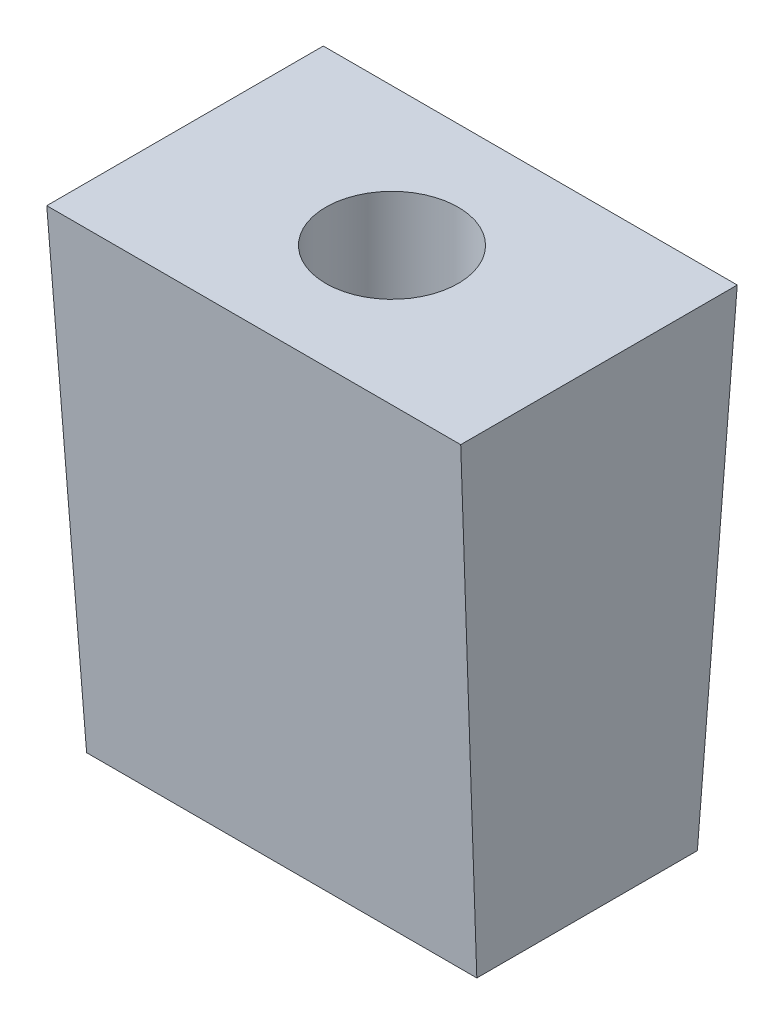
from build123d import *

# Parameters (mm, degrees)
EXTRUSION1_DEPTH             = 8.15
ENL_V_MAT_EXTRU_1_DEPTH      = 18.472049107
ENL_V_MAT_EXTRU_1_DEPTH_BACK = 18.472049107
ESQUISSE3_R                  = 2.45
ENL_V_MAT_EXTRU_2_DEPTH      = 9.2
ESQUISSE4_R                  = 1.25
ENL_V_MAT_EXTRU_3_DEPTH      = 8.15
ESQUISSE5_R                  = 1.95
ENL_V_MAT_EXTRU_4_DEPTH      = 2.9


with BuildPart() as part:
    # Esquisse1 → Extrusion1 (new body)
    with BuildSketch(Plane.XY):
        Polygon((-5.75, 0), (5.75, 0), (6.1, 14.2), (-6.1, 14.2), align=None)
    extrude(amount=-EXTRUSION1_DEPTH)

    # Esquisse2 → Enl_v. mat.-Extru.1 (cut, two sides: drawn at the far end of the back side and taken through both)
    with BuildSketch(Plane(origin=(0, 0, 0), x_dir=(0, 0, -1), z_dir=(1, 0, 0)).offset(-ENL_V_MAT_EXTRU_1_DEPTH_BACK)):
        Polygon((-2.479256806, 56.873268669), (0, 14.2), (0.825, 0), (4.075, 0), (7.325, 0), (8.15, 14.2), (10.629256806, 56.873268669), (10.629256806, -28.617188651), (-2.479256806, -28.617188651), align=None)
    extrude(amount=ENL_V_MAT_EXTRU_1_DEPTH + ENL_V_MAT_EXTRU_1_DEPTH_BACK, mode=Mode.SUBTRACT)

    # Esquisse3 → Enl_v. mat.-Extru.2 (cut)
    with BuildSketch(Plane.XZ):
        with Locations(Location((0, -4.075, 0), (0, 0, 270))):
            Circle(ESQUISSE3_R)
    extrude(amount=-ENL_V_MAT_EXTRU_2_DEPTH, mode=Mode.SUBTRACT)

    # Esquisse4 → Enl_v. mat.-Extru.3 (cut)
    with BuildSketch(Plane.XZ.offset(-9.2)):
        with Locations(Location((0, -4.075, 0), (0, 0, 270))):
            Circle(ESQUISSE4_R)
    extrude(amount=-ENL_V_MAT_EXTRU_3_DEPTH, mode=Mode.SUBTRACT)

    # Esquisse5 → Enl_v. mat.-Extru.4 (cut)
    with BuildSketch(Plane(origin=(0, 14.2, 0), x_dir=(-1, 0, 0), z_dir=(0, 1, 0))):
        with Locations(Location((0, -4.075, 0), (0, 0, 90))):
            Circle(ESQUISSE5_R)
    extrude(amount=-ENL_V_MAT_EXTRU_4_DEPTH, mode=Mode.SUBTRACT)


solid = part.part
